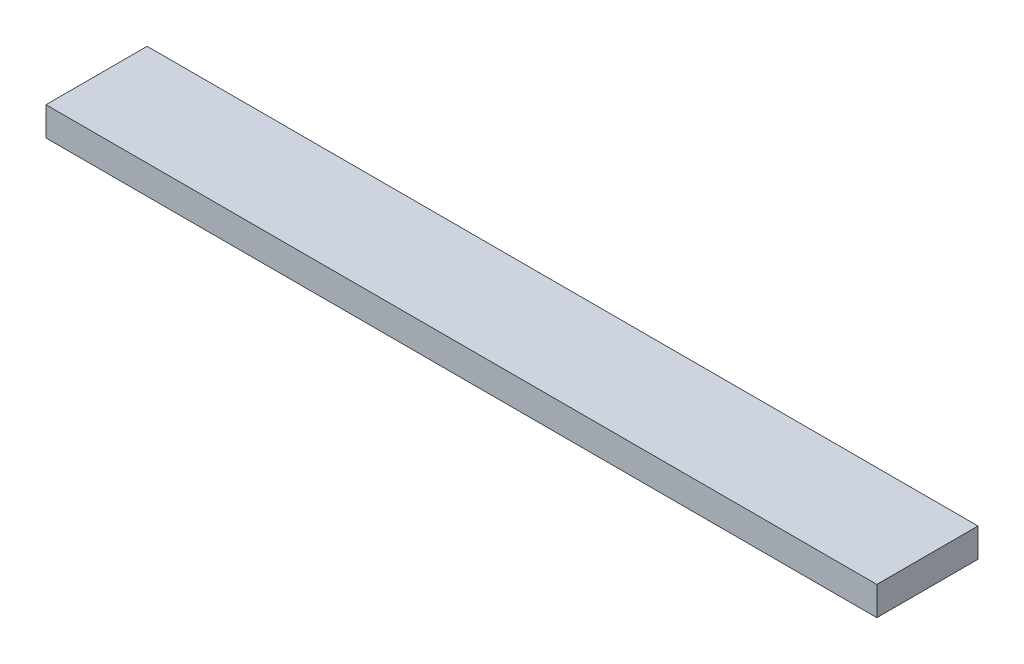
ISO-10303-21;
HEADER;
FILE_DESCRIPTION(('STEP AP214'),'2;1');
FILE_NAME('part.step','',(''),(''),'','','');
FILE_SCHEMA(('AUTOMOTIVE_DESIGN { 1 0 10303 214 1 1 1 1 }'));
ENDSEC;
DATA;
#1=APPLICATION_CONTEXT('core data for automotive mechanical design processes');
#2=APPLICATION_PROTOCOL_DEFINITION('international standard','automotive_design',2000,#1);
#3=PRODUCT_CONTEXT('',#1,'mechanical');
#4=PRODUCT('Part','Part','',(#3));
#5=PRODUCT_RELATED_PRODUCT_CATEGORY('part','',(#4));
#6=PRODUCT_DEFINITION_FORMATION('','',#4);
#7=PRODUCT_DEFINITION_CONTEXT('part definition',#1,'design');
#8=PRODUCT_DEFINITION('design','',#6,#7);
#9=PRODUCT_DEFINITION_SHAPE('','',#8);
#10=(LENGTH_UNIT() NAMED_UNIT(*) SI_UNIT(.MILLI.,.METRE.));
#11=(NAMED_UNIT(*) PLANE_ANGLE_UNIT() SI_UNIT($,.RADIAN.));
#12=(NAMED_UNIT(*) SI_UNIT($,.STERADIAN.) SOLID_ANGLE_UNIT());
#13=UNCERTAINTY_MEASURE_WITH_UNIT(LENGTH_MEASURE(1.E-05),#10,'distance_accuracy_value','');
#14=(GEOMETRIC_REPRESENTATION_CONTEXT(3) GLOBAL_UNCERTAINTY_ASSIGNED_CONTEXT((#13)) GLOBAL_UNIT_ASSIGNED_CONTEXT((#10,
#11,#12)) REPRESENTATION_CONTEXT('',''));
#15=CARTESIAN_POINT('',(0.,0.,0.));
#16=DIRECTION('',(0.,0.,1.));
#17=DIRECTION('',(1.,0.,0.));
#18=AXIS2_PLACEMENT_3D('',#15,#16,#17);
#19=CARTESIAN_POINT('',(0.,0.,100.));
#20=DIRECTION('',(1.,0.,0.));
#21=DIRECTION('',(0.,0.,-1.));
#22=AXIS2_PLACEMENT_3D('',#19,#20,#21);
#23=PLANE('',#22);
#24=DIRECTION('',(0.,-1.,0.));
#25=VECTOR('',#24,1.);
#26=CARTESIAN_POINT('',(0.,0.,0.));
#27=LINE('',#26,#25);
#28=CARTESIAN_POINT('',(0.,28.5160080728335,0.));
#29=VERTEX_POINT('',#28);
#30=CARTESIAN_POINT('',(0.,0.,0.));
#31=VERTEX_POINT('',#30);
#32=EDGE_CURVE('E99',#29,#31,#27,.T.);
#33=ORIENTED_EDGE('',*,*,#32,.T.);
#34=DIRECTION('',(0.,0.,-1.));
#35=VECTOR('',#34,1.);
#36=CARTESIAN_POINT('',(0.,0.,100.));
#37=LINE('',#36,#35);
#38=CARTESIAN_POINT('',(0.,0.,100.));
#39=VERTEX_POINT('',#38);
#40=EDGE_CURVE('E11',#39,#31,#37,.T.);
#41=ORIENTED_EDGE('',*,*,#40,.F.);
#42=DIRECTION('',(0.,-1.,0.));
#43=VECTOR('',#42,1.);
#44=CARTESIAN_POINT('',(0.,0.,100.));
#45=LINE('',#44,#43);
#46=CARTESIAN_POINT('',(0.,28.5160080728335,100.));
#47=VERTEX_POINT('',#46);
#48=EDGE_CURVE('E87',#47,#39,#45,.T.);
#49=ORIENTED_EDGE('',*,*,#48,.F.);
#50=DIRECTION('',(0.,0.,-1.));
#51=VECTOR('',#50,1.);
#52=CARTESIAN_POINT('',(0.,28.5160080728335,100.));
#53=LINE('',#52,#51);
#54=EDGE_CURVE('E95',#47,#29,#53,.T.);
#55=ORIENTED_EDGE('',*,*,#54,.T.);
#56=EDGE_LOOP('',(#33,#41,#49,#55));
#57=FACE_BOUND('',#56,.T.);
#58=ADVANCED_FACE('F36',(#57),#23,.F.);
#59=CARTESIAN_POINT('',(0.,0.,100.));
#60=DIRECTION('',(0.,1.,0.));
#61=DIRECTION('',(0.,0.,1.));
#62=AXIS2_PLACEMENT_3D('',#59,#60,#61);
#63=PLANE('',#62);
#64=DIRECTION('',(1.,0.,0.));
#65=VECTOR('',#64,1.);
#66=CARTESIAN_POINT('',(0.,0.,0.));
#67=LINE('',#66,#65);
#68=CARTESIAN_POINT('',(821.261032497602,0.,0.));
#69=VERTEX_POINT('',#68);
#70=EDGE_CURVE('E91',#31,#69,#67,.T.);
#71=ORIENTED_EDGE('',*,*,#70,.T.);
#72=DIRECTION('',(0.,0.,-1.));
#73=VECTOR('',#72,1.);
#74=CARTESIAN_POINT('',(821.261032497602,0.,100.));
#75=LINE('',#74,#73);
#76=CARTESIAN_POINT('',(821.261032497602,0.,100.));
#77=VERTEX_POINT('',#76);
#78=EDGE_CURVE('E44',#77,#69,#75,.T.);
#79=ORIENTED_EDGE('',*,*,#78,.F.);
#80=DIRECTION('',(1.,0.,0.));
#81=VECTOR('',#80,1.);
#82=CARTESIAN_POINT('',(0.,0.,100.));
#83=LINE('',#82,#81);
#84=EDGE_CURVE('E82',#39,#77,#83,.T.);
#85=ORIENTED_EDGE('',*,*,#84,.F.);
#86=ORIENTED_EDGE('',*,*,#40,.T.);
#87=EDGE_LOOP('',(#71,#79,#85,#86));
#88=FACE_BOUND('',#87,.T.);
#89=ADVANCED_FACE('F90',(#88),#63,.F.);
#90=CARTESIAN_POINT('',(821.261032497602,0.,100.));
#91=DIRECTION('',(-1.,0.,0.));
#92=DIRECTION('',(0.,0.,1.));
#93=AXIS2_PLACEMENT_3D('',#90,#91,#92);
#94=PLANE('',#93);
#95=DIRECTION('',(0.,1.,0.));
#96=VECTOR('',#95,1.);
#97=CARTESIAN_POINT('',(821.261032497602,0.,0.));
#98=LINE('',#97,#96);
#99=CARTESIAN_POINT('',(821.261032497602,28.5160080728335,0.));
#100=VERTEX_POINT('',#99);
#101=EDGE_CURVE('E69',#69,#100,#98,.T.);
#102=ORIENTED_EDGE('',*,*,#101,.T.);
#103=DIRECTION('',(0.,0.,-1.));
#104=VECTOR('',#103,1.);
#105=CARTESIAN_POINT('',(821.261032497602,28.5160080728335,100.));
#106=LINE('',#105,#104);
#107=CARTESIAN_POINT('',(821.261032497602,28.5160080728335,100.));
#108=VERTEX_POINT('',#107);
#109=EDGE_CURVE('E92',#108,#100,#106,.T.);
#110=ORIENTED_EDGE('',*,*,#109,.F.);
#111=DIRECTION('',(0.,1.,0.));
#112=VECTOR('',#111,1.);
#113=CARTESIAN_POINT('',(821.261032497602,0.,100.));
#114=LINE('',#113,#112);
#115=EDGE_CURVE('E85',#77,#108,#114,.T.);
#116=ORIENTED_EDGE('',*,*,#115,.F.);
#117=ORIENTED_EDGE('',*,*,#78,.T.);
#118=EDGE_LOOP('',(#102,#110,#116,#117));
#119=FACE_BOUND('',#118,.T.);
#120=ADVANCED_FACE('F93',(#119),#94,.F.);
#121=CARTESIAN_POINT('',(0.,28.5160080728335,100.));
#122=DIRECTION('',(0.,-1.,0.));
#123=DIRECTION('',(0.,0.,-1.));
#124=AXIS2_PLACEMENT_3D('',#121,#122,#123);
#125=PLANE('',#124);
#126=DIRECTION('',(-1.,0.,0.));
#127=VECTOR('',#126,1.);
#128=CARTESIAN_POINT('',(0.,28.5160080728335,0.));
#129=LINE('',#128,#127);
#130=EDGE_CURVE('E75',#100,#29,#129,.T.);
#131=ORIENTED_EDGE('',*,*,#130,.T.);
#132=ORIENTED_EDGE('',*,*,#54,.F.);
#133=DIRECTION('',(-1.,0.,0.));
#134=VECTOR('',#133,1.);
#135=CARTESIAN_POINT('',(0.,28.5160080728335,100.));
#136=LINE('',#135,#134);
#137=EDGE_CURVE('E52',#108,#47,#136,.T.);
#138=ORIENTED_EDGE('',*,*,#137,.F.);
#139=ORIENTED_EDGE('',*,*,#109,.T.);
#140=EDGE_LOOP('',(#131,#132,#138,#139));
#141=FACE_BOUND('',#140,.T.);
#142=ADVANCED_FACE('F106',(#141),#125,.F.);
#143=CARTESIAN_POINT('',(0.,28.5160080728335,100.));
#144=DIRECTION('',(0.,0.,-1.));
#145=DIRECTION('',(-1.,0.,0.));
#146=AXIS2_PLACEMENT_3D('',#143,#144,#145);
#147=PLANE('',#146);
#148=ORIENTED_EDGE('',*,*,#48,.T.);
#149=ORIENTED_EDGE('',*,*,#84,.T.);
#150=ORIENTED_EDGE('',*,*,#115,.T.);
#151=ORIENTED_EDGE('',*,*,#137,.T.);
#152=EDGE_LOOP('',(#148,#149,#150,#151));
#153=FACE_BOUND('',#152,.T.);
#154=ADVANCED_FACE('F83',(#153),#147,.F.);
#155=CARTESIAN_POINT('',(0.,28.5160080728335,0.));
#156=DIRECTION('',(0.,0.,-1.));
#157=DIRECTION('',(-1.,0.,0.));
#158=AXIS2_PLACEMENT_3D('',#155,#156,#157);
#159=PLANE('',#158);
#160=ORIENTED_EDGE('',*,*,#32,.F.);
#161=ORIENTED_EDGE('',*,*,#130,.F.);
#162=ORIENTED_EDGE('',*,*,#101,.F.);
#163=ORIENTED_EDGE('',*,*,#70,.F.);
#164=EDGE_LOOP('',(#160,#161,#162,#163));
#165=FACE_BOUND('',#164,.T.);
#166=ADVANCED_FACE('F109',(#165),#159,.T.);
#167=CLOSED_SHELL('',(#58,#89,#120,#142,#154,#166));
#168=MANIFOLD_SOLID_BREP('B2',#167);
#169=ADVANCED_BREP_SHAPE_REPRESENTATION('',(#18,#168),#14);
#170=SHAPE_DEFINITION_REPRESENTATION(#9,#169);
ENDSEC;
END-ISO-10303-21;
